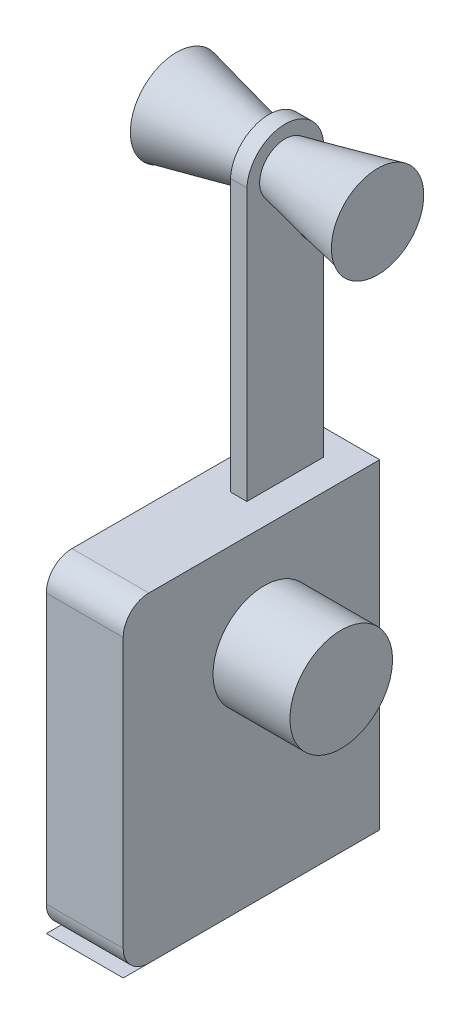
ISO-10303-21;
HEADER;
FILE_DESCRIPTION(('STEP AP214'),'2;1');
FILE_NAME('part.step','',(''),(''),'','','');
FILE_SCHEMA(('AUTOMOTIVE_DESIGN { 1 0 10303 214 1 1 1 1 }'));
ENDSEC;
DATA;
#1=APPLICATION_CONTEXT('core data for automotive mechanical design processes');
#2=APPLICATION_PROTOCOL_DEFINITION('international standard','automotive_design',2000,#1);
#3=PRODUCT_CONTEXT('',#1,'mechanical');
#4=PRODUCT('Part','Part','',(#3));
#5=PRODUCT_RELATED_PRODUCT_CATEGORY('part','',(#4));
#6=PRODUCT_DEFINITION_FORMATION('','',#4);
#7=PRODUCT_DEFINITION_CONTEXT('part definition',#1,'design');
#8=PRODUCT_DEFINITION('design','',#6,#7);
#9=PRODUCT_DEFINITION_SHAPE('','',#8);
#10=(LENGTH_UNIT() NAMED_UNIT(*) SI_UNIT(.MILLI.,.METRE.));
#11=(NAMED_UNIT(*) PLANE_ANGLE_UNIT() SI_UNIT($,.RADIAN.));
#12=(NAMED_UNIT(*) SI_UNIT($,.STERADIAN.) SOLID_ANGLE_UNIT());
#13=UNCERTAINTY_MEASURE_WITH_UNIT(LENGTH_MEASURE(1.E-05),#10,'distance_accuracy_value','');
#14=(GEOMETRIC_REPRESENTATION_CONTEXT(3) GLOBAL_UNCERTAINTY_ASSIGNED_CONTEXT((#13)) GLOBAL_UNIT_ASSIGNED_CONTEXT((#10,
#11,#12)) REPRESENTATION_CONTEXT('',''));
#15=CARTESIAN_POINT('',(0.,0.,0.));
#16=DIRECTION('',(0.,0.,1.));
#17=DIRECTION('',(1.,0.,0.));
#18=AXIS2_PLACEMENT_3D('',#15,#16,#17);
#19=CARTESIAN_POINT('',(-7.493,155.575,25.4));
#20=DIRECTION('',(-1.,0.,0.));
#21=DIRECTION('',(0.,0.,1.));
#22=AXIS2_PLACEMENT_3D('',#19,#20,#21);
#23=PLANE('',#22);
#24=CARTESIAN_POINT('',(-7.493,146.05,15.8933351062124));
#25=DIRECTION('',(1.,0.,0.));
#26=DIRECTION('',(0.,0.,-1.));
#27=AXIS2_PLACEMENT_3D('',#24,#25,#26);
#28=CIRCLE('',#27,6.35);
#29=CARTESIAN_POINT('',(-7.493,151.052776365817,19.8041826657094));
#30=VERTEX_POINT('',#29);
#31=EDGE_CURVE('E806',#30,#30,#28,.T.);
#32=ORIENTED_EDGE('',*,*,#31,.F.);
#33=EDGE_LOOP('',(#32));
#34=FACE_BOUND('',#33,.T.);
#35=DIRECTION('',(0.,-1.,0.));
#36=VECTOR('',#35,1.);
#37=CARTESIAN_POINT('',(-7.493,155.575,6.38667021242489));
#38=LINE('',#37,#36);
#39=CARTESIAN_POINT('',(-7.493,146.640717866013,6.38667021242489));
#40=VERTEX_POINT('',#39);
#41=CARTESIAN_POINT('',(-7.493,79.375,6.38667021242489));
#42=VERTEX_POINT('',#41);
#43=EDGE_CURVE('E85',#40,#42,#38,.T.);
#44=ORIENTED_EDGE('',*,*,#43,.F.);
#45=CARTESIAN_POINT('',(-7.493,146.05,15.8933351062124));
#46=DIRECTION('',(1.,0.,0.));
#47=DIRECTION('',(0.,0.,-1.));
#48=AXIS2_PLACEMENT_3D('',#45,#46,#47);
#49=CIRCLE('',#48,9.525);
#50=CARTESIAN_POINT('',(-7.493,146.640717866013,25.4));
#51=VERTEX_POINT('',#50);
#52=EDGE_CURVE('E186',#40,#51,#49,.T.);
#53=ORIENTED_EDGE('',*,*,#52,.T.);
#54=DIRECTION('',(0.,-1.,0.));
#55=VECTOR('',#54,1.);
#56=CARTESIAN_POINT('',(-7.493,155.575,25.4));
#57=LINE('',#56,#55);
#58=CARTESIAN_POINT('',(-7.493,79.375,25.4));
#59=VERTEX_POINT('',#58);
#60=EDGE_CURVE('E820',#51,#59,#57,.T.);
#61=ORIENTED_EDGE('',*,*,#60,.T.);
#62=DIRECTION('',(0.,0.,-1.));
#63=VECTOR('',#62,1.);
#64=CARTESIAN_POINT('',(-7.493,79.375,25.4));
#65=LINE('',#64,#63);
#66=EDGE_CURVE('E199',#59,#42,#65,.T.);
#67=ORIENTED_EDGE('',*,*,#66,.T.);
#68=EDGE_LOOP('',(#44,#53,#61,#67));
#69=FACE_BOUND('',#68,.T.);
#70=ADVANCED_FACE('F69',(#34,#69),#23,.F.);
#71=CARTESIAN_POINT('',(-11.557,155.575,25.4));
#72=DIRECTION('',(1.,0.,0.));
#73=DIRECTION('',(0.,0.,-1.));
#74=AXIS2_PLACEMENT_3D('',#71,#72,#73);
#75=PLANE('',#74);
#76=CARTESIAN_POINT('',(-11.557,146.05,15.8933351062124));
#77=DIRECTION('',(-1.,0.,0.));
#78=DIRECTION('',(0.,0.,1.));
#79=AXIS2_PLACEMENT_3D('',#76,#77,#78);
#80=CIRCLE('',#79,6.35);
#81=CARTESIAN_POINT('',(-11.557,148.840030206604,21.5975643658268));
#82=VERTEX_POINT('',#81);
#83=EDGE_CURVE('E825',#82,#82,#80,.T.);
#84=ORIENTED_EDGE('',*,*,#83,.F.);
#85=EDGE_LOOP('',(#84));
#86=FACE_BOUND('',#85,.T.);
#87=CARTESIAN_POINT('',(-11.557,146.05,15.8933351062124));
#88=DIRECTION('',(1.,0.,0.));
#89=DIRECTION('',(0.,0.,-1.));
#90=AXIS2_PLACEMENT_3D('',#87,#88,#89);
#91=CIRCLE('',#90,9.525);
#92=CARTESIAN_POINT('',(-11.557,146.640717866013,6.38667021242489));
#93=VERTEX_POINT('',#92);
#94=CARTESIAN_POINT('',(-11.557,146.640717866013,25.4));
#95=VERTEX_POINT('',#94);
#96=EDGE_CURVE('E810',#93,#95,#91,.T.);
#97=ORIENTED_EDGE('',*,*,#96,.F.);
#98=DIRECTION('',(0.,-1.,0.));
#99=VECTOR('',#98,1.);
#100=CARTESIAN_POINT('',(-11.557,155.575,6.3866702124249));
#101=LINE('',#100,#99);
#102=CARTESIAN_POINT('',(-11.557,79.375,6.3866702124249));
#103=VERTEX_POINT('',#102);
#104=EDGE_CURVE('E93',#93,#103,#101,.T.);
#105=ORIENTED_EDGE('',*,*,#104,.T.);
#106=DIRECTION('',(0.,0.,1.));
#107=VECTOR('',#106,1.);
#108=CARTESIAN_POINT('',(-11.557,79.375,25.4));
#109=LINE('',#108,#107);
#110=CARTESIAN_POINT('',(-11.557,79.375,25.4));
#111=VERTEX_POINT('',#110);
#112=EDGE_CURVE('E815',#103,#111,#109,.T.);
#113=ORIENTED_EDGE('',*,*,#112,.T.);
#114=DIRECTION('',(0.,-1.,0.));
#115=VECTOR('',#114,1.);
#116=CARTESIAN_POINT('',(-11.557,155.575,25.4));
#117=LINE('',#116,#115);
#118=EDGE_CURVE('E205',#95,#111,#117,.T.);
#119=ORIENTED_EDGE('',*,*,#118,.F.);
#120=EDGE_LOOP('',(#97,#105,#113,#119));
#121=FACE_BOUND('',#120,.T.);
#122=ADVANCED_FACE('F375',(#86,#121),#75,.F.);
#123=CARTESIAN_POINT('',(-11.557,155.575,6.3866702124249));
#124=DIRECTION('',(0.,0.,1.));
#125=DIRECTION('',(1.,0.,0.));
#126=AXIS2_PLACEMENT_3D('',#123,#124,#125);
#127=PLANE('',#126);
#128=DIRECTION('',(1.,0.,0.));
#129=VECTOR('',#128,1.);
#130=CARTESIAN_POINT('',(-83.693,146.640717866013,6.38667021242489));
#131=LINE('',#130,#129);
#132=EDGE_CURVE('E188',#93,#40,#131,.T.);
#133=ORIENTED_EDGE('',*,*,#132,.T.);
#134=ORIENTED_EDGE('',*,*,#43,.T.);
#135=DIRECTION('',(-1.,0.,0.));
#136=VECTOR('',#135,1.);
#137=CARTESIAN_POINT('',(-11.557,79.375,6.3866702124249));
#138=LINE('',#137,#136);
#139=EDGE_CURVE('E813',#42,#103,#138,.T.);
#140=ORIENTED_EDGE('',*,*,#139,.T.);
#141=ORIENTED_EDGE('',*,*,#104,.F.);
#142=EDGE_LOOP('',(#133,#134,#140,#141));
#143=FACE_BOUND('',#142,.T.);
#144=ADVANCED_FACE('F194',(#143),#127,.F.);
#145=CARTESIAN_POINT('',(-7.493,155.575,25.4));
#146=DIRECTION('',(0.,0.,-1.));
#147=DIRECTION('',(-1.,0.,0.));
#148=AXIS2_PLACEMENT_3D('',#145,#146,#147);
#149=PLANE('',#148);
#150=DIRECTION('',(1.,0.,0.));
#151=VECTOR('',#150,1.);
#152=CARTESIAN_POINT('',(-83.693,146.640717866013,25.4));
#153=LINE('',#152,#151);
#154=EDGE_CURVE('E190',#95,#51,#153,.T.);
#155=ORIENTED_EDGE('',*,*,#154,.F.);
#156=ORIENTED_EDGE('',*,*,#118,.T.);
#157=DIRECTION('',(1.,0.,0.));
#158=VECTOR('',#157,1.);
#159=CARTESIAN_POINT('',(-7.493,79.375,25.4));
#160=LINE('',#159,#158);
#161=EDGE_CURVE('E817',#111,#59,#160,.T.);
#162=ORIENTED_EDGE('',*,*,#161,.T.);
#163=ORIENTED_EDGE('',*,*,#60,.F.);
#164=EDGE_LOOP('',(#155,#156,#162,#163));
#165=FACE_BOUND('',#164,.T.);
#166=ADVANCED_FACE('F414',(#165),#149,.F.);
#167=CARTESIAN_POINT('',(0.,79.375,5.08));
#168=DIRECTION('',(0.,-1.,0.));
#169=DIRECTION('',(0.,0.,-1.));
#170=AXIS2_PLACEMENT_3D('',#167,#168,#169);
#171=PLANE('',#170);
#172=DIRECTION('',(0.,0.,-1.));
#173=VECTOR('',#172,1.);
#174=CARTESIAN_POINT('',(-19.05,79.375,5.08));
#175=LINE('',#174,#173);
#176=CARTESIAN_POINT('',(-19.05,79.375,57.1499999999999));
#177=VERTEX_POINT('',#176);
#178=CARTESIAN_POINT('',(-19.05,79.375,0.));
#179=VERTEX_POINT('',#178);
#180=EDGE_CURVE('E296',#177,#179,#175,.T.);
#181=ORIENTED_EDGE('',*,*,#180,.F.);
#182=DIRECTION('',(1.,0.,0.));
#183=VECTOR('',#182,1.);
#184=CARTESIAN_POINT('',(-58.42,79.375,57.1499999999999));
#185=LINE('',#184,#183);
#186=CARTESIAN_POINT('',(0.,79.375,57.1499999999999));
#187=VERTEX_POINT('',#186);
#188=EDGE_CURVE('E213',#177,#187,#185,.T.);
#189=ORIENTED_EDGE('',*,*,#188,.T.);
#190=DIRECTION('',(0.,0.,-1.));
#191=VECTOR('',#190,1.);
#192=CARTESIAN_POINT('',(0.,79.375,5.08));
#193=LINE('',#192,#191);
#194=CARTESIAN_POINT('',(0.,79.375,0.));
#195=VERTEX_POINT('',#194);
#196=EDGE_CURVE('E298',#187,#195,#193,.T.);
#197=ORIENTED_EDGE('',*,*,#196,.T.);
#198=DIRECTION('',(-1.,0.,0.));
#199=VECTOR('',#198,1.);
#200=CARTESIAN_POINT('',(0.,79.375,0.));
#201=LINE('',#200,#199);
#202=EDGE_CURVE('E280',#195,#179,#201,.T.);
#203=ORIENTED_EDGE('',*,*,#202,.T.);
#204=EDGE_LOOP('',(#181,#189,#197,#203));
#205=FACE_BOUND('',#204,.T.);
#206=ORIENTED_EDGE('',*,*,#66,.F.);
#207=ORIENTED_EDGE('',*,*,#161,.F.);
#208=ORIENTED_EDGE('',*,*,#112,.F.);
#209=ORIENTED_EDGE('',*,*,#139,.F.);
#210=EDGE_LOOP('',(#206,#207,#208,#209));
#211=FACE_BOUND('',#210,.T.);
#212=ADVANCED_FACE('F324',(#205,#211),#171,.F.);
#213=CARTESIAN_POINT('',(0.,0.,5.08));
#214=DIRECTION('',(-1.,0.,0.));
#215=DIRECTION('',(0.,0.,1.));
#216=AXIS2_PLACEMENT_3D('',#213,#214,#215);
#217=PLANE('',#216);
#218=CARTESIAN_POINT('',(0.,53.975,28.575));
#219=DIRECTION('',(1.,0.,0.));
#220=DIRECTION('',(0.,0.,-1.));
#221=AXIS2_PLACEMENT_3D('',#218,#219,#220);
#222=CIRCLE('',#221,12.7);
#223=CARTESIAN_POINT('',(0.,53.975,41.275));
#224=VERTEX_POINT('',#223);
#225=EDGE_CURVE('E12',#224,#224,#222,.T.);
#226=ORIENTED_EDGE('',*,*,#225,.F.);
#227=EDGE_LOOP('',(#226));
#228=FACE_BOUND('',#227,.T.);
#229=CARTESIAN_POINT('',(0.,6.35,57.15));
#230=DIRECTION('',(1.,0.,0.));
#231=DIRECTION('',(0.,0.,-1.));
#232=AXIS2_PLACEMENT_3D('',#229,#230,#231);
#233=CIRCLE('',#232,6.35);
#234=CARTESIAN_POINT('',(0.,6.35000000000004,63.5));
#235=VERTEX_POINT('',#234);
#236=CARTESIAN_POINT('',(0.,0.000765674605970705,57.2486077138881));
#237=VERTEX_POINT('',#236);
#238=EDGE_CURVE('E209',#235,#237,#233,.T.);
#239=ORIENTED_EDGE('',*,*,#238,.T.);
#240=DIRECTION('',(0.,0.000122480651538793,-0.999999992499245));
#241=VECTOR('',#240,1.);
#242=CARTESIAN_POINT('',(0.,0.00777752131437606,9.52595885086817E-07));
#243=LINE('',#242,#241);
#244=CARTESIAN_POINT('',(0.,0.,63.5));
#245=VERTEX_POINT('',#244);
#246=EDGE_CURVE('E212',#245,#237,#243,.T.);
#247=ORIENTED_EDGE('',*,*,#246,.F.);
#248=DIRECTION('',(0.,0.,-1.));
#249=VECTOR('',#248,1.);
#250=CARTESIAN_POINT('',(0.,0.,5.08));
#251=LINE('',#250,#249);
#252=CARTESIAN_POINT('',(0.,0.,0.));
#253=VERTEX_POINT('',#252);
#254=EDGE_CURVE('E300',#245,#253,#251,.T.);
#255=ORIENTED_EDGE('',*,*,#254,.T.);
#256=DIRECTION('',(0.,1.,0.));
#257=VECTOR('',#256,1.);
#258=CARTESIAN_POINT('',(0.,0.,0.));
#259=LINE('',#258,#257);
#260=EDGE_CURVE('E277',#253,#195,#259,.T.);
#261=ORIENTED_EDGE('',*,*,#260,.T.);
#262=ORIENTED_EDGE('',*,*,#196,.F.);
#263=CARTESIAN_POINT('',(0.,73.025,57.15));
#264=DIRECTION('',(1.,0.,0.));
#265=DIRECTION('',(0.,0.,-1.));
#266=AXIS2_PLACEMENT_3D('',#263,#264,#265);
#267=CIRCLE('',#266,6.34999999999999);
#268=CARTESIAN_POINT('',(0.,73.0249999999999,63.5));
#269=VERTEX_POINT('',#268);
#270=EDGE_CURVE('E203',#187,#269,#267,.T.);
#271=ORIENTED_EDGE('',*,*,#270,.T.);
#272=DIRECTION('',(0.,1.,0.));
#273=VECTOR('',#272,1.);
#274=CARTESIAN_POINT('',(0.,79.375,63.5));
#275=LINE('',#274,#273);
#276=EDGE_CURVE('E234',#235,#269,#275,.T.);
#277=ORIENTED_EDGE('',*,*,#276,.F.);
#278=EDGE_LOOP('',(#239,#247,#255,#261,#262,#271,#277));
#279=FACE_BOUND('',#278,.T.);
#280=ADVANCED_FACE('F317',(#228,#279),#217,.F.);
#281=CARTESIAN_POINT('',(-19.05,0.,5.08));
#282=DIRECTION('',(1.,0.,0.));
#283=DIRECTION('',(0.,1.,0.));
#284=AXIS2_PLACEMENT_3D('',#281,#282,#283);
#285=PLANE('',#284);
#286=CARTESIAN_POINT('',(-19.05,6.35,57.15));
#287=DIRECTION('',(1.,0.,0.));
#288=DIRECTION('',(0.,1.,0.));
#289=AXIS2_PLACEMENT_3D('',#286,#287,#288);
#290=CIRCLE('',#289,6.35);
#291=CARTESIAN_POINT('',(-19.05,6.35000000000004,63.5));
#292=VERTEX_POINT('',#291);
#293=CARTESIAN_POINT('',(-19.05,0.000765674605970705,57.2486077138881));
#294=VERTEX_POINT('',#293);
#295=EDGE_CURVE('E227',#292,#294,#290,.T.);
#296=ORIENTED_EDGE('',*,*,#295,.F.);
#297=DIRECTION('',(0.,-1.,0.));
#298=VECTOR('',#297,1.);
#299=CARTESIAN_POINT('',(-19.05,79.375,63.5));
#300=LINE('',#299,#298);
#301=CARTESIAN_POINT('',(-19.05,73.025,63.5));
#302=VERTEX_POINT('',#301);
#303=EDGE_CURVE('E229',#302,#292,#300,.T.);
#304=ORIENTED_EDGE('',*,*,#303,.F.);
#305=CARTESIAN_POINT('',(-19.05,73.025,57.15));
#306=DIRECTION('',(1.,0.,0.));
#307=DIRECTION('',(0.,1.,0.));
#308=AXIS2_PLACEMENT_3D('',#305,#306,#307);
#309=CIRCLE('',#308,6.34999999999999);
#310=EDGE_CURVE('E218',#177,#302,#309,.T.);
#311=ORIENTED_EDGE('',*,*,#310,.F.);
#312=ORIENTED_EDGE('',*,*,#180,.T.);
#313=DIRECTION('',(0.,-1.,0.));
#314=VECTOR('',#313,1.);
#315=CARTESIAN_POINT('',(-19.05,0.,0.));
#316=LINE('',#315,#314);
#317=CARTESIAN_POINT('',(-19.05,47.625,0.));
#318=VERTEX_POINT('',#317);
#319=EDGE_CURVE('E283',#179,#318,#316,.T.);
#320=ORIENTED_EDGE('',*,*,#319,.T.);
#321=DIRECTION('',(0.,0.,-1.));
#322=VECTOR('',#321,1.);
#323=CARTESIAN_POINT('',(-19.05,47.625,5.08));
#324=LINE('',#323,#322);
#325=CARTESIAN_POINT('',(-19.05,47.625,5.08));
#326=VERTEX_POINT('',#325);
#327=EDGE_CURVE('E293',#326,#318,#324,.T.);
#328=ORIENTED_EDGE('',*,*,#327,.F.);
#329=DIRECTION('',(0.,-1.,0.));
#330=VECTOR('',#329,1.);
#331=CARTESIAN_POINT('',(-19.05,79.375,5.08));
#332=LINE('',#331,#330);
#333=CARTESIAN_POINT('',(-19.05,0.,5.08));
#334=VERTEX_POINT('',#333);
#335=EDGE_CURVE('E238',#326,#334,#332,.T.);
#336=ORIENTED_EDGE('',*,*,#335,.T.);
#337=DIRECTION('',(0.,0.,-1.));
#338=VECTOR('',#337,1.);
#339=CARTESIAN_POINT('',(-19.05,0.,63.5));
#340=LINE('',#339,#338);
#341=CARTESIAN_POINT('',(-19.05,0.,63.5));
#342=VERTEX_POINT('',#341);
#343=EDGE_CURVE('E237',#342,#334,#340,.T.);
#344=ORIENTED_EDGE('',*,*,#343,.F.);
#345=DIRECTION('',(0.,0.000122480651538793,-0.999999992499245));
#346=VECTOR('',#345,1.);
#347=CARTESIAN_POINT('',(-19.05,0.00715531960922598,5.08000087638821));
#348=LINE('',#347,#346);
#349=EDGE_CURVE('E224',#342,#294,#348,.T.);
#350=ORIENTED_EDGE('',*,*,#349,.T.);
#351=EDGE_LOOP('',(#296,#304,#311,#312,#320,#328,#336,#344,#350));
#352=FACE_BOUND('',#351,.T.);
#353=ADVANCED_FACE('F329',(#352),#285,.F.);
#354=CARTESIAN_POINT('',(0.,0.,63.5));
#355=DIRECTION('',(0.,0.,1.));
#356=DIRECTION('',(1.,0.,0.));
#357=AXIS2_PLACEMENT_3D('',#354,#355,#356);
#358=PLANE('',#357);
#359=ORIENTED_EDGE('',*,*,#303,.T.);
#360=DIRECTION('',(1.,0.,0.));
#361=VECTOR('',#360,1.);
#362=CARTESIAN_POINT('',(-58.42,6.35,63.5));
#363=LINE('',#362,#361);
#364=EDGE_CURVE('E73',#292,#235,#363,.T.);
#365=ORIENTED_EDGE('',*,*,#364,.T.);
#366=ORIENTED_EDGE('',*,*,#276,.T.);
#367=DIRECTION('',(1.,0.,0.));
#368=VECTOR('',#367,1.);
#369=CARTESIAN_POINT('',(-58.42,73.025,63.5));
#370=LINE('',#369,#368);
#371=EDGE_CURVE('E241',#302,#269,#370,.T.);
#372=ORIENTED_EDGE('',*,*,#371,.F.);
#373=EDGE_LOOP('',(#359,#365,#366,#372));
#374=FACE_BOUND('',#373,.T.);
#375=ADVANCED_FACE('F312',(#374),#358,.T.);
#376=CARTESIAN_POINT('',(-38.1,0.,5.08));
#377=DIRECTION('',(1.,0.,0.));
#378=DIRECTION('',(0.,0.,-1.));
#379=AXIS2_PLACEMENT_3D('',#376,#377,#378);
#380=PLANE('',#379);
#381=DIRECTION('',(0.,-1.,0.));
#382=VECTOR('',#381,1.);
#383=CARTESIAN_POINT('',(-38.1,0.,0.));
#384=LINE('',#383,#382);
#385=CARTESIAN_POINT('',(-38.1,43.053,0.));
#386=VERTEX_POINT('',#385);
#387=CARTESIAN_POINT('',(-38.1,4.57200000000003,0.));
#388=VERTEX_POINT('',#387);
#389=EDGE_CURVE('E270',#386,#388,#384,.T.);
#390=ORIENTED_EDGE('',*,*,#389,.T.);
#391=DIRECTION('',(0.,0.,-1.));
#392=VECTOR('',#391,1.);
#393=CARTESIAN_POINT('',(-38.1,4.57200000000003,5.08));
#394=LINE('',#393,#392);
#395=CARTESIAN_POINT('',(-38.1,4.57200000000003,5.08));
#396=VERTEX_POINT('',#395);
#397=EDGE_CURVE('E242',#396,#388,#394,.T.);
#398=ORIENTED_EDGE('',*,*,#397,.F.);
#399=DIRECTION('',(0.,-1.,0.));
#400=VECTOR('',#399,1.);
#401=CARTESIAN_POINT('',(-38.1,0.,5.08));
#402=LINE('',#401,#400);
#403=CARTESIAN_POINT('',(-38.1,43.053,5.08));
#404=VERTEX_POINT('',#403);
#405=EDGE_CURVE('E253',#404,#396,#402,.T.);
#406=ORIENTED_EDGE('',*,*,#405,.F.);
#407=DIRECTION('',(0.,0.,-1.));
#408=VECTOR('',#407,1.);
#409=CARTESIAN_POINT('',(-38.1,43.053,5.08));
#410=LINE('',#409,#408);
#411=EDGE_CURVE('E264',#404,#386,#410,.T.);
#412=ORIENTED_EDGE('',*,*,#411,.T.);
#413=EDGE_LOOP('',(#390,#398,#406,#412));
#414=FACE_BOUND('',#413,.T.);
#415=ADVANCED_FACE('F365',(#414),#380,.F.);
#416=CARTESIAN_POINT('',(-33.528,4.572,5.08));
#417=DIRECTION('',(0.,0.,-1.));
#418=DIRECTION('',(-1.,0.,0.));
#419=AXIS2_PLACEMENT_3D('',#416,#417,#418);
#420=CYLINDRICAL_SURFACE('',#419,4.572);
#421=CARTESIAN_POINT('',(-33.528,4.572,0.));
#422=DIRECTION('',(0.,0.,1.));
#423=DIRECTION('',(1.,0.,0.));
#424=AXIS2_PLACEMENT_3D('',#421,#422,#423);
#425=CIRCLE('',#424,4.572);
#426=CARTESIAN_POINT('',(-33.528,0.,0.));
#427=VERTEX_POINT('',#426);
#428=EDGE_CURVE('E273',#388,#427,#425,.T.);
#429=ORIENTED_EDGE('',*,*,#428,.T.);
#430=DIRECTION('',(0.,0.,-1.));
#431=VECTOR('',#430,1.);
#432=CARTESIAN_POINT('',(-33.528,0.,5.08));
#433=LINE('',#432,#431);
#434=CARTESIAN_POINT('',(-33.528,0.,5.08));
#435=VERTEX_POINT('',#434);
#436=EDGE_CURVE('E303',#435,#427,#433,.T.);
#437=ORIENTED_EDGE('',*,*,#436,.F.);
#438=CARTESIAN_POINT('',(-33.528,4.572,5.08));
#439=DIRECTION('',(0.,0.,1.));
#440=DIRECTION('',(1.,0.,0.));
#441=AXIS2_PLACEMENT_3D('',#438,#439,#440);
#442=CIRCLE('',#441,4.572);
#443=EDGE_CURVE('E256',#396,#435,#442,.T.);
#444=ORIENTED_EDGE('',*,*,#443,.F.);
#445=ORIENTED_EDGE('',*,*,#397,.T.);
#446=EDGE_LOOP('',(#429,#437,#444,#445));
#447=FACE_BOUND('',#446,.T.);
#448=ADVANCED_FACE('F363',(#447),#420,.T.);
#449=CARTESIAN_POINT('',(0.,0.,5.08));
#450=DIRECTION('',(0.,1.,0.));
#451=DIRECTION('',(0.,0.,1.));
#452=AXIS2_PLACEMENT_3D('',#449,#450,#451);
#453=PLANE('',#452);
#454=DIRECTION('',(1.,0.,0.));
#455=VECTOR('',#454,1.);
#456=CARTESIAN_POINT('',(0.,0.,0.));
#457=LINE('',#456,#455);
#458=EDGE_CURVE('E275',#427,#253,#457,.T.);
#459=ORIENTED_EDGE('',*,*,#458,.T.);
#460=ORIENTED_EDGE('',*,*,#254,.F.);
#461=DIRECTION('',(1.,0.,0.));
#462=VECTOR('',#461,1.);
#463=CARTESIAN_POINT('',(-19.05,0.,63.5));
#464=LINE('',#463,#462);
#465=EDGE_CURVE('E232',#342,#245,#464,.T.);
#466=ORIENTED_EDGE('',*,*,#465,.F.);
#467=ORIENTED_EDGE('',*,*,#343,.T.);
#468=DIRECTION('',(1.,0.,0.));
#469=VECTOR('',#468,1.);
#470=CARTESIAN_POINT('',(0.,0.,5.08));
#471=LINE('',#470,#469);
#472=EDGE_CURVE('E258',#435,#334,#471,.T.);
#473=ORIENTED_EDGE('',*,*,#472,.F.);
#474=ORIENTED_EDGE('',*,*,#436,.T.);
#475=EDGE_LOOP('',(#459,#460,#466,#467,#473,#474));
#476=FACE_BOUND('',#475,.T.);
#477=ADVANCED_FACE('F340',(#476),#453,.F.);
#478=CARTESIAN_POINT('',(0.,47.625,5.08));
#479=DIRECTION('',(0.,-1.,0.));
#480=DIRECTION('',(0.,0.,-1.));
#481=AXIS2_PLACEMENT_3D('',#478,#479,#480);
#482=PLANE('',#481);
#483=DIRECTION('',(-1.,0.,0.));
#484=VECTOR('',#483,1.);
#485=CARTESIAN_POINT('',(0.,47.625,0.));
#486=LINE('',#485,#484);
#487=CARTESIAN_POINT('',(-33.528,47.625,0.));
#488=VERTEX_POINT('',#487);
#489=EDGE_CURVE('E285',#318,#488,#486,.T.);
#490=ORIENTED_EDGE('',*,*,#489,.T.);
#491=DIRECTION('',(0.,0.,-1.));
#492=VECTOR('',#491,1.);
#493=CARTESIAN_POINT('',(-33.528,47.625,5.08));
#494=LINE('',#493,#492);
#495=CARTESIAN_POINT('',(-33.528,47.625,5.08));
#496=VERTEX_POINT('',#495);
#497=EDGE_CURVE('E290',#496,#488,#494,.T.);
#498=ORIENTED_EDGE('',*,*,#497,.F.);
#499=DIRECTION('',(-1.,0.,0.));
#500=VECTOR('',#499,1.);
#501=CARTESIAN_POINT('',(0.,47.625,5.08));
#502=LINE('',#501,#500);
#503=EDGE_CURVE('E260',#326,#496,#502,.T.);
#504=ORIENTED_EDGE('',*,*,#503,.F.);
#505=ORIENTED_EDGE('',*,*,#327,.T.);
#506=EDGE_LOOP('',(#490,#498,#504,#505));
#507=FACE_BOUND('',#506,.T.);
#508=ADVANCED_FACE('F351',(#507),#482,.F.);
#509=CARTESIAN_POINT('',(-31.7499999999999,6.35,5.08));
#510=DIRECTION('',(0.,0.,-1.));
#511=DIRECTION('',(-1.,0.,0.));
#512=AXIS2_PLACEMENT_3D('',#509,#510,#511);
#513=CYLINDRICAL_SURFACE('',#512,2.286);
#514=CARTESIAN_POINT('',(-31.7499999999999,6.35,5.08));
#515=DIRECTION('',(0.,0.,1.));
#516=DIRECTION('',(1.,0.,0.));
#517=AXIS2_PLACEMENT_3D('',#514,#515,#516);
#518=CIRCLE('',#517,2.286);
#519=CARTESIAN_POINT('',(-29.4639999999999,6.35,5.08));
#520=VERTEX_POINT('',#519);
#521=EDGE_CURVE('E249',#520,#520,#518,.T.);
#522=ORIENTED_EDGE('',*,*,#521,.T.);
#523=EDGE_LOOP('',(#522));
#524=FACE_BOUND('',#523,.T.);
#525=CARTESIAN_POINT('',(-31.7499999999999,6.35,0.));
#526=DIRECTION('',(0.,0.,1.));
#527=DIRECTION('',(1.,0.,0.));
#528=AXIS2_PLACEMENT_3D('',#525,#526,#527);
#529=CIRCLE('',#528,2.286);
#530=CARTESIAN_POINT('',(-29.4639999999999,6.35,0.));
#531=VERTEX_POINT('',#530);
#532=EDGE_CURVE('E267',#531,#531,#529,.T.);
#533=ORIENTED_EDGE('',*,*,#532,.F.);
#534=EDGE_LOOP('',(#533));
#535=FACE_BOUND('',#534,.T.);
#536=ADVANCED_FACE('F409',(#524,#535),#513,.F.);
#537=CARTESIAN_POINT('',(-31.7499999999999,41.275,5.08));
#538=DIRECTION('',(0.,0.,-1.));
#539=DIRECTION('',(-1.,0.,0.));
#540=AXIS2_PLACEMENT_3D('',#537,#538,#539);
#541=CYLINDRICAL_SURFACE('',#540,2.286);
#542=CARTESIAN_POINT('',(-31.7499999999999,41.275,5.08));
#543=DIRECTION('',(0.,0.,1.));
#544=DIRECTION('',(1.,0.,0.));
#545=AXIS2_PLACEMENT_3D('',#542,#543,#544);
#546=CIRCLE('',#545,2.286);
#547=CARTESIAN_POINT('',(-29.4639999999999,41.275,5.08));
#548=VERTEX_POINT('',#547);
#549=EDGE_CURVE('E246',#548,#548,#546,.T.);
#550=ORIENTED_EDGE('',*,*,#549,.T.);
#551=EDGE_LOOP('',(#550));
#552=FACE_BOUND('',#551,.T.);
#553=CARTESIAN_POINT('',(-31.7499999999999,41.275,0.));
#554=DIRECTION('',(0.,0.,1.));
#555=DIRECTION('',(1.,0.,0.));
#556=AXIS2_PLACEMENT_3D('',#553,#554,#555);
#557=CIRCLE('',#556,2.286);
#558=CARTESIAN_POINT('',(-29.4639999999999,41.275,0.));
#559=VERTEX_POINT('',#558);
#560=EDGE_CURVE('E245',#559,#559,#557,.T.);
#561=ORIENTED_EDGE('',*,*,#560,.F.);
#562=EDGE_LOOP('',(#561));
#563=FACE_BOUND('',#562,.T.);
#564=ADVANCED_FACE('F71',(#552,#563),#541,.F.);
#565=CARTESIAN_POINT('',(-33.528,43.053,5.08));
#566=DIRECTION('',(0.,0.,-1.));
#567=DIRECTION('',(-1.,0.,0.));
#568=AXIS2_PLACEMENT_3D('',#565,#566,#567);
#569=CYLINDRICAL_SURFACE('',#568,4.572);
#570=CARTESIAN_POINT('',(-33.528,43.053,0.));
#571=DIRECTION('',(0.,0.,1.));
#572=DIRECTION('',(1.,0.,0.));
#573=AXIS2_PLACEMENT_3D('',#570,#571,#572);
#574=CIRCLE('',#573,4.572);
#575=EDGE_CURVE('E250',#488,#386,#574,.T.);
#576=ORIENTED_EDGE('',*,*,#575,.T.);
#577=ORIENTED_EDGE('',*,*,#411,.F.);
#578=CARTESIAN_POINT('',(-33.528,43.053,5.08));
#579=DIRECTION('',(0.,0.,1.));
#580=DIRECTION('',(1.,0.,0.));
#581=AXIS2_PLACEMENT_3D('',#578,#579,#580);
#582=CIRCLE('',#581,4.572);
#583=EDGE_CURVE('E262',#496,#404,#582,.T.);
#584=ORIENTED_EDGE('',*,*,#583,.F.);
#585=ORIENTED_EDGE('',*,*,#497,.T.);
#586=EDGE_LOOP('',(#576,#577,#584,#585));
#587=FACE_BOUND('',#586,.T.);
#588=ADVANCED_FACE('F355',(#587),#569,.T.);
#589=CARTESIAN_POINT('',(0.,0.,5.08));
#590=DIRECTION('',(0.,0.,1.));
#591=DIRECTION('',(1.,0.,0.));
#592=AXIS2_PLACEMENT_3D('',#589,#590,#591);
#593=PLANE('',#592);
#594=ORIENTED_EDGE('',*,*,#335,.F.);
#595=ORIENTED_EDGE('',*,*,#503,.T.);
#596=ORIENTED_EDGE('',*,*,#583,.T.);
#597=ORIENTED_EDGE('',*,*,#405,.T.);
#598=ORIENTED_EDGE('',*,*,#443,.T.);
#599=ORIENTED_EDGE('',*,*,#472,.T.);
#600=EDGE_LOOP('',(#594,#595,#596,#597,#598,#599));
#601=FACE_BOUND('',#600,.T.);
#602=ORIENTED_EDGE('',*,*,#549,.F.);
#603=EDGE_LOOP('',(#602));
#604=FACE_BOUND('',#603,.T.);
#605=ORIENTED_EDGE('',*,*,#521,.F.);
#606=EDGE_LOOP('',(#605));
#607=FACE_BOUND('',#606,.T.);
#608=ADVANCED_FACE('F359',(#601,#604,#607),#593,.T.);
#609=CARTESIAN_POINT('',(0.,0.,0.));
#610=DIRECTION('',(0.,0.,1.));
#611=DIRECTION('',(1.,0.,0.));
#612=AXIS2_PLACEMENT_3D('',#609,#610,#611);
#613=PLANE('',#612);
#614=ORIENTED_EDGE('',*,*,#560,.T.);
#615=EDGE_LOOP('',(#614));
#616=FACE_BOUND('',#615,.T.);
#617=ORIENTED_EDGE('',*,*,#532,.T.);
#618=EDGE_LOOP('',(#617));
#619=FACE_BOUND('',#618,.T.);
#620=ORIENTED_EDGE('',*,*,#389,.F.);
#621=ORIENTED_EDGE('',*,*,#575,.F.);
#622=ORIENTED_EDGE('',*,*,#489,.F.);
#623=ORIENTED_EDGE('',*,*,#319,.F.);
#624=ORIENTED_EDGE('',*,*,#202,.F.);
#625=ORIENTED_EDGE('',*,*,#260,.F.);
#626=ORIENTED_EDGE('',*,*,#458,.F.);
#627=ORIENTED_EDGE('',*,*,#428,.F.);
#628=EDGE_LOOP('',(#620,#621,#622,#623,#624,#625,#626,#627));
#629=FACE_BOUND('',#628,.T.);
#630=ADVANCED_FACE('F346',(#616,#619,#629),#613,.F.);
#631=CARTESIAN_POINT('',(-58.42,73.025,57.15));
#632=DIRECTION('',(1.,0.,0.));
#633=DIRECTION('',(0.,0.,-1.));
#634=AXIS2_PLACEMENT_3D('',#631,#632,#633);
#635=CYLINDRICAL_SURFACE('',#634,6.34999999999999);
#636=ORIENTED_EDGE('',*,*,#310,.T.);
#637=ORIENTED_EDGE('',*,*,#371,.T.);
#638=ORIENTED_EDGE('',*,*,#270,.F.);
#639=ORIENTED_EDGE('',*,*,#188,.F.);
#640=EDGE_LOOP('',(#636,#637,#638,#639));
#641=FACE_BOUND('',#640,.T.);
#642=ADVANCED_FACE('F320',(#641),#635,.T.);
#643=CARTESIAN_POINT('',(-58.42,6.35,57.15));
#644=DIRECTION('',(1.,0.,0.));
#645=DIRECTION('',(0.,0.,-1.));
#646=AXIS2_PLACEMENT_3D('',#643,#644,#645);
#647=CYLINDRICAL_SURFACE('',#646,6.35);
#648=ORIENTED_EDGE('',*,*,#295,.T.);
#649=DIRECTION('',(1.,0.,0.));
#650=VECTOR('',#649,1.);
#651=CARTESIAN_POINT('',(-58.42,0.000765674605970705,57.2486077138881));
#652=LINE('',#651,#650);
#653=EDGE_CURVE('E216',#294,#237,#652,.T.);
#654=ORIENTED_EDGE('',*,*,#653,.T.);
#655=ORIENTED_EDGE('',*,*,#238,.F.);
#656=ORIENTED_EDGE('',*,*,#364,.F.);
#657=EDGE_LOOP('',(#648,#654,#655,#656));
#658=FACE_BOUND('',#657,.T.);
#659=ADVANCED_FACE('F333',(#658),#647,.T.);
#660=CARTESIAN_POINT('',(-58.42,0.00777752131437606,9.52595885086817E-07));
#661=DIRECTION('',(0.,-0.999999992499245,-0.000122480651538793));
#662=DIRECTION('',(0.,0.000122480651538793,-0.999999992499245));
#663=AXIS2_PLACEMENT_3D('',#660,#661,#662);
#664=PLANE('',#663);
#665=ORIENTED_EDGE('',*,*,#465,.T.);
#666=ORIENTED_EDGE('',*,*,#246,.T.);
#667=ORIENTED_EDGE('',*,*,#653,.F.);
#668=ORIENTED_EDGE('',*,*,#349,.F.);
#669=EDGE_LOOP('',(#665,#666,#667,#668));
#670=FACE_BOUND('',#669,.T.);
#671=ADVANCED_FACE('F335',(#670),#664,.F.);
#672=CARTESIAN_POINT('',(19.05,53.975,28.575));
#673=DIRECTION('',(-1.,0.,0.));
#674=DIRECTION('',(0.,0.,1.));
#675=AXIS2_PLACEMENT_3D('',#672,#673,#674);
#676=CYLINDRICAL_SURFACE('',#675,12.7);
#677=CARTESIAN_POINT('',(19.05,53.975,28.575));
#678=DIRECTION('',(1.,0.,0.));
#679=DIRECTION('',(0.,0.,-1.));
#680=AXIS2_PLACEMENT_3D('',#677,#678,#679);
#681=CIRCLE('',#680,12.7);
#682=CARTESIAN_POINT('',(19.05,53.975,41.275));
#683=VERTEX_POINT('',#682);
#684=EDGE_CURVE('E200',#683,#683,#681,.T.);
#685=CARTESIAN_POINT('',(19.05,53.975,41.275));
#686=CARTESIAN_POINT('',(18.8515625,53.975,41.275));
#687=CARTESIAN_POINT('',(18.653125,53.975,41.275));
#688=CARTESIAN_POINT('',(18.25625,53.975,41.275));
#689=CARTESIAN_POINT('',(18.0578125,53.975,41.275));
#690=CARTESIAN_POINT('',(17.6609375,53.975,41.275));
#691=CARTESIAN_POINT('',(17.4625,53.975,41.275));
#692=CARTESIAN_POINT('',(17.065625,53.975,41.275));
#693=CARTESIAN_POINT('',(16.8671875,53.975,41.275));
#694=CARTESIAN_POINT('',(16.4703125,53.975,41.275));
#695=CARTESIAN_POINT('',(16.271875,53.975,41.275));
#696=CARTESIAN_POINT('',(15.875,53.975,41.275));
#697=CARTESIAN_POINT('',(15.6765625,53.975,41.275));
#698=CARTESIAN_POINT('',(15.2796875,53.975,41.275));
#699=CARTESIAN_POINT('',(15.08125,53.975,41.275));
#700=CARTESIAN_POINT('',(14.684375,53.975,41.275));
#701=CARTESIAN_POINT('',(14.4859375,53.975,41.275));
#702=CARTESIAN_POINT('',(14.0890625,53.975,41.275));
#703=CARTESIAN_POINT('',(13.890625,53.975,41.275));
#704=CARTESIAN_POINT('',(13.49375,53.975,41.275));
#705=CARTESIAN_POINT('',(13.2953125,53.975,41.275));
#706=CARTESIAN_POINT('',(12.8984375,53.975,41.275));
#707=CARTESIAN_POINT('',(12.7,53.975,41.275));
#708=CARTESIAN_POINT('',(12.303125,53.975,41.275));
#709=CARTESIAN_POINT('',(12.1046875,53.975,41.275));
#710=CARTESIAN_POINT('',(11.7078125,53.975,41.275));
#711=CARTESIAN_POINT('',(11.509375,53.975,41.275));
#712=CARTESIAN_POINT('',(11.1125,53.975,41.275));
#713=CARTESIAN_POINT('',(10.9140625,53.975,41.275));
#714=CARTESIAN_POINT('',(10.5171875,53.975,41.275));
#715=CARTESIAN_POINT('',(10.31875,53.975,41.275));
#716=CARTESIAN_POINT('',(9.921875,53.975,41.275));
#717=CARTESIAN_POINT('',(9.7234375,53.975,41.275));
#718=CARTESIAN_POINT('',(9.3265625,53.975,41.275));
#719=CARTESIAN_POINT('',(9.128125,53.975,41.275));
#720=CARTESIAN_POINT('',(8.73125,53.975,41.275));
#721=CARTESIAN_POINT('',(8.5328125,53.975,41.275));
#722=CARTESIAN_POINT('',(8.1359375,53.975,41.275));
#723=CARTESIAN_POINT('',(7.9375,53.975,41.275));
#724=CARTESIAN_POINT('',(7.540625,53.975,41.275));
#725=CARTESIAN_POINT('',(7.3421875,53.975,41.275));
#726=CARTESIAN_POINT('',(6.9453125,53.975,41.275));
#727=CARTESIAN_POINT('',(6.746875,53.975,41.275));
#728=CARTESIAN_POINT('',(6.35,53.975,41.275));
#729=CARTESIAN_POINT('',(6.1515625,53.975,41.275));
#730=CARTESIAN_POINT('',(5.7546875,53.975,41.275));
#731=CARTESIAN_POINT('',(5.55625,53.975,41.275));
#732=CARTESIAN_POINT('',(5.159375,53.975,41.275));
#733=CARTESIAN_POINT('',(4.9609375,53.975,41.275));
#734=CARTESIAN_POINT('',(4.5640625,53.975,41.275));
#735=CARTESIAN_POINT('',(4.365625,53.975,41.275));
#736=CARTESIAN_POINT('',(3.96875,53.975,41.275));
#737=CARTESIAN_POINT('',(3.7703125,53.975,41.275));
#738=CARTESIAN_POINT('',(3.3734375,53.975,41.275));
#739=CARTESIAN_POINT('',(3.175,53.975,41.275));
#740=CARTESIAN_POINT('',(2.778125,53.975,41.275));
#741=CARTESIAN_POINT('',(2.5796875,53.975,41.275));
#742=CARTESIAN_POINT('',(2.1828125,53.975,41.275));
#743=CARTESIAN_POINT('',(1.984375,53.975,41.275));
#744=CARTESIAN_POINT('',(1.5875,53.975,41.275));
#745=CARTESIAN_POINT('',(1.3890625,53.975,41.275));
#746=CARTESIAN_POINT('',(0.992187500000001,53.975,41.275));
#747=CARTESIAN_POINT('',(0.793750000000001,53.975,41.275));
#748=CARTESIAN_POINT('',(0.396875,53.975,41.275));
#749=CARTESIAN_POINT('',(0.1984375,53.975,41.275));
#750=CARTESIAN_POINT('',(0.,53.975,41.275));
#751=B_SPLINE_CURVE_WITH_KNOTS('',3,(#685,#686,#687,#688,#689,#690,#691,#692,#693,#694,#695,
#696,#697,#698,#699,#700,#701,#702,#703,#704,#705,#706,#707,#708,#709,#710,#711,#712,#713,#714,
#715,#716,#717,#718,#719,#720,#721,#722,#723,#724,#725,#726,#727,#728,#729,#730,#731,#732,#733,
#734,#735,#736,#737,#738,#739,#740,#741,#742,#743,#744,#745,#746,#747,#748,#749,#750),
.UNSPECIFIED.,.F.,.F.,(4,2,2,2,2,2,2,2,2,2,2,2,2,2,2,2,2,2,2,2,2,2,2,2,2,2,2,2,2,2,2,2,4),(0.,
0.595312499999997,1.190625,1.7859375,2.38125,2.9765625,3.571875,4.1671875,4.7625,5.3578125,
5.953125,6.5484375,7.14375,7.7390625,8.334375,8.9296875,9.525,10.1203125,10.715625,11.3109375,
11.90625,12.5015625,13.096875,13.6921875,14.2875,14.8828125,15.478125,16.0734375,16.66875,
17.2640625,17.859375,18.4546875,19.05),.UNSPECIFIED.);
#752=EDGE_CURVE('BSEAM389',#683,#224,#751,.T.);
#753=ORIENTED_EDGE('',*,*,#684,.F.);
#754=ORIENTED_EDGE('',*,*,#225,.T.);
#755=ORIENTED_EDGE('',*,*,#752,.T.);
#756=ORIENTED_EDGE('',*,*,#752,.F.);
#757=EDGE_LOOP('',(#753,#755,#754,#756));
#758=FACE_BOUND('',#757,.T.);
#759=ADVANCED_FACE('F389',(#758),#676,.T.);
#760=CARTESIAN_POINT('',(19.05,53.975,28.575));
#761=DIRECTION('',(1.,0.,0.));
#762=DIRECTION('',(0.,0.,-1.));
#763=AXIS2_PLACEMENT_3D('',#760,#761,#762);
#764=PLANE('',#763);
#765=ORIENTED_EDGE('',*,*,#684,.T.);
#766=EDGE_LOOP('',(#765));
#767=FACE_BOUND('',#766,.T.);
#768=ADVANCED_FACE('F386',(#767),#764,.T.);
#769=CARTESIAN_POINT('',(-83.693,146.05,15.8933351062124));
#770=DIRECTION('',(1.,0.,0.));
#771=DIRECTION('',(0.,0.,-1.));
#772=AXIS2_PLACEMENT_3D('',#769,#770,#771);
#773=CYLINDRICAL_SURFACE('',#772,9.525);
#774=ORIENTED_EDGE('',*,*,#96,.T.);
#775=ORIENTED_EDGE('',*,*,#154,.T.);
#776=ORIENTED_EDGE('',*,*,#52,.F.);
#777=ORIENTED_EDGE('',*,*,#132,.F.);
#778=EDGE_LOOP('',(#774,#775,#776,#777));
#779=FACE_BOUND('',#778,.T.);
#780=ADVANCED_FACE('F187',(#779),#773,.T.);
#781=CARTESIAN_POINT('',(15.367,146.05,15.8933351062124));
#782=DIRECTION('',(1.,0.,0.));
#783=DIRECTION('',(0.,0.,-1.));
#784=AXIS2_PLACEMENT_3D('',#781,#782,#783);
#785=PLANE('',#784);
#786=CARTESIAN_POINT('',(15.367,146.05,15.8933351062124));
#787=DIRECTION('',(1.,0.,0.));
#788=DIRECTION('',(0.,0.,-1.));
#789=AXIS2_PLACEMENT_3D('',#786,#787,#788);
#790=CIRCLE('',#789,11.43);
#791=CARTESIAN_POINT('',(15.367,156.419528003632,20.7014312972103));
#792=VERTEX_POINT('',#791);
#793=EDGE_CURVE('E195',#792,#792,#790,.T.);
#794=ORIENTED_EDGE('',*,*,#793,.T.);
#795=EDGE_LOOP('',(#794));
#796=FACE_BOUND('',#795,.T.);
#797=ADVANCED_FACE('F473',(#796),#785,.T.);
#798=CARTESIAN_POINT('',(-7.493,151.052776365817,19.8041826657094));
#799=CARTESIAN_POINT('',(15.367,156.419528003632,20.7014312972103));
#800=CARTESIAN_POINT('',(-7.493,143.231081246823,29.8097353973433));
#801=CARTESIAN_POINT('',(15.367,146.803335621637,41.4404873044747));
#802=CARTESIAN_POINT('',(-7.493,133.225528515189,21.9880402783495));
#803=CARTESIAN_POINT('',(15.367,126.064279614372,31.824294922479));
#804=CARTESIAN_POINT('',(-7.493,141.047223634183,11.9824875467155));
#805=CARTESIAN_POINT('',(15.367,135.680471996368,11.0852389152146));
#806=CARTESIAN_POINT('',(-7.493,148.868918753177,1.97693481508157));
#807=CARTESIAN_POINT('',(15.367,145.296664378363,-9.65381709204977));
#808=CARTESIAN_POINT('',(-7.493,158.874471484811,9.79862993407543));
#809=CARTESIAN_POINT('',(15.367,166.035720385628,-0.0376247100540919));
#810=CARTESIAN_POINT('',(-7.493,151.052776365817,19.8041826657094));
#811=CARTESIAN_POINT('',(15.367,156.419528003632,20.7014312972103));
#812=(BOUNDED_SURFACE() B_SPLINE_SURFACE(3,1,((#798,#799),(#800,#801),(#802,#803),(#804,#805),
(#806,#807),(#808,#809),(#810,#811)),.UNSPECIFIED.,.T.,.F.,.F.) B_SPLINE_SURFACE_WITH_KNOTS((4,
3,4),(2,2),(0.,0.5,1.),(0.,1.),
.UNSPECIFIED.) GEOMETRIC_REPRESENTATION_ITEM() RATIONAL_B_SPLINE_SURFACE(((1.,1.),
(0.333333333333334,0.333333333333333),(0.333333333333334,0.333333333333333),(1.,1.),
(0.333333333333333,0.333333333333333),(0.333333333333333,0.333333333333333),(1.,1.))) REPRESENTATION_ITEM('') SURFACE());
#813=CARTESIAN_POINT('',(-7.493,151.052776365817,19.8041826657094));
#814=CARTESIAN_POINT('',(-7.254875,151.108680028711,19.8135290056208));
#815=CARTESIAN_POINT('',(-7.01675,151.164583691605,19.8228753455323));
#816=CARTESIAN_POINT('',(-6.5405,151.276391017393,19.8415680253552));
#817=CARTESIAN_POINT('',(-6.302375,151.332294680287,19.8509143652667));
#818=CARTESIAN_POINT('',(-5.82612499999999,151.444102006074,19.8696070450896));
#819=CARTESIAN_POINT('',(-5.588,151.500005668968,19.8789533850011));
#820=CARTESIAN_POINT('',(-5.11175,151.611812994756,19.8976460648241));
#821=CARTESIAN_POINT('',(-4.873625,151.66771665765,19.9069924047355));
#822=CARTESIAN_POINT('',(-4.397375,151.779523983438,19.9256850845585));
#823=CARTESIAN_POINT('',(-4.15925,151.835427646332,19.9350314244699));
#824=CARTESIAN_POINT('',(-3.683,151.94723497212,19.9537241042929));
#825=CARTESIAN_POINT('',(-3.444875,152.003138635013,19.9630704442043));
#826=CARTESIAN_POINT('',(-2.968625,152.114945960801,19.9817631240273));
#827=CARTESIAN_POINT('',(-2.7305,152.170849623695,19.9911094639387));
#828=CARTESIAN_POINT('',(-2.25425,152.282656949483,20.0098021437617));
#829=CARTESIAN_POINT('',(-2.016125,152.338560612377,20.0191484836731));
#830=CARTESIAN_POINT('',(-1.539875,152.450367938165,20.0378411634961));
#831=CARTESIAN_POINT('',(-1.30175,152.506271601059,20.0471875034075));
#832=CARTESIAN_POINT('',(-0.825499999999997,152.618078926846,20.0658801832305));
#833=CARTESIAN_POINT('',(-0.587374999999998,152.67398258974,20.0752265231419));
#834=CARTESIAN_POINT('',(-0.111124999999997,152.785789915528,20.0939192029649));
#835=CARTESIAN_POINT('',(0.127000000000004,152.841693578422,20.1032655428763));
#836=CARTESIAN_POINT('',(0.603250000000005,152.95350090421,20.1219582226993));
#837=CARTESIAN_POINT('',(0.841375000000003,153.009404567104,20.1313045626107));
#838=CARTESIAN_POINT('',(1.317625,153.121211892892,20.1499972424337));
#839=CARTESIAN_POINT('',(1.55575,153.177115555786,20.1593435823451));
#840=CARTESIAN_POINT('',(2.032,153.288922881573,20.1780362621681));
#841=CARTESIAN_POINT('',(2.270125,153.344826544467,20.1873826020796));
#842=CARTESIAN_POINT('',(2.746375,153.456633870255,20.2060752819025));
#843=CARTESIAN_POINT('',(2.9845,153.512537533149,20.215421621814));
#844=CARTESIAN_POINT('',(3.46075,153.624344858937,20.2341143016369));
#845=CARTESIAN_POINT('',(3.698875,153.680248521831,20.2434606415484));
#846=CARTESIAN_POINT('',(4.175125,153.792055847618,20.2621533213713));
#847=CARTESIAN_POINT('',(4.41325,153.847959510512,20.2714996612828));
#848=CARTESIAN_POINT('',(4.8895,153.9597668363,20.2901923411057));
#849=CARTESIAN_POINT('',(5.127625,154.015670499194,20.2995386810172));
#850=CARTESIAN_POINT('',(5.603875,154.127477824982,20.3182313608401));
#851=CARTESIAN_POINT('',(5.842,154.183381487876,20.3275777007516));
#852=CARTESIAN_POINT('',(6.31825,154.295188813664,20.3462703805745));
#853=CARTESIAN_POINT('',(6.556375,154.351092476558,20.355616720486));
#854=CARTESIAN_POINT('',(7.032625,154.462899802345,20.3743094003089));
#855=CARTESIAN_POINT('',(7.27075,154.518803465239,20.3836557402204));
#856=CARTESIAN_POINT('',(7.747,154.630610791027,20.4023484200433));
#857=CARTESIAN_POINT('',(7.985125,154.686514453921,20.4116947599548));
#858=CARTESIAN_POINT('',(8.461375,154.798321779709,20.4303874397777));
#859=CARTESIAN_POINT('',(8.6995,154.854225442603,20.4397337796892));
#860=CARTESIAN_POINT('',(9.17575,154.966032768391,20.4584264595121));
#861=CARTESIAN_POINT('',(9.413875,155.021936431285,20.4677727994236));
#862=CARTESIAN_POINT('',(9.890125,155.133743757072,20.4864654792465));
#863=CARTESIAN_POINT('',(10.12825,155.189647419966,20.495811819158));
#864=CARTESIAN_POINT('',(10.6045,155.301454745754,20.5145044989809));
#865=CARTESIAN_POINT('',(10.842625,155.357358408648,20.5238508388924));
#866=CARTESIAN_POINT('',(11.318875,155.469165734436,20.5425435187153));
#867=CARTESIAN_POINT('',(11.557,155.52506939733,20.5518898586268));
#868=CARTESIAN_POINT('',(12.03325,155.636876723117,20.5705825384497));
#869=CARTESIAN_POINT('',(12.271375,155.692780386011,20.5799288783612));
#870=CARTESIAN_POINT('',(12.747625,155.804587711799,20.5986215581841));
#871=CARTESIAN_POINT('',(12.98575,155.860491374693,20.6079678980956));
#872=CARTESIAN_POINT('',(13.462,155.972298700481,20.6266605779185));
#873=CARTESIAN_POINT('',(13.700125,156.028202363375,20.63600691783));
#874=CARTESIAN_POINT('',(14.176375,156.140009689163,20.6546995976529));
#875=CARTESIAN_POINT('',(14.4145,156.195913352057,20.6640459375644));
#876=CARTESIAN_POINT('',(14.89075,156.307720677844,20.6827386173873));
#877=CARTESIAN_POINT('',(15.128875,156.363624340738,20.6920849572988));
#878=CARTESIAN_POINT('',(15.367,156.419528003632,20.7014312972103));
#879=B_SPLINE_CURVE_WITH_KNOTS('',3,(#813,#814,#815,#816,#817,#818,#819,#820,#821,#822,#823,
#824,#825,#826,#827,#828,#829,#830,#831,#832,#833,#834,#835,#836,#837,#838,#839,#840,#841,#842,
#843,#844,#845,#846,#847,#848,#849,#850,#851,#852,#853,#854,#855,#856,#857,#858,#859,#860,#861,
#862,#863,#864,#865,#866,#867,#868,#869,#870,#871,#872,#873,#874,#875,#876,#877,#878),
.UNSPECIFIED.,.F.,.F.,(4,2,2,2,2,2,2,2,2,2,2,2,2,2,2,2,2,2,2,2,2,2,2,2,2,2,2,2,2,2,2,2,4),(0.,
0.734332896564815,1.46866579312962,2.20299868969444,2.93733158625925,3.67166448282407,
4.40599737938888,5.14033027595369,5.8746631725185,6.60899606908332,7.34332896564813,
8.07766186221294,8.81199475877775,9.54632765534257,10.2806605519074,11.0149934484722,
11.749326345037,12.4836592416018,13.2179921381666,13.9523250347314,14.6866579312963,
15.4209908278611,16.1553237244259,16.8896566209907,17.6239895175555,18.3583224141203,
19.0926553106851,19.8269882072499,20.5613211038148,21.2956540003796,22.0299868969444,
22.7643197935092,23.498652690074),.UNSPECIFIED.);
#880=EDGE_CURVE('BSEAM480',#30,#792,#879,.T.);
#881=ORIENTED_EDGE('',*,*,#31,.T.);
#882=ORIENTED_EDGE('',*,*,#793,.F.);
#883=ORIENTED_EDGE('',*,*,#880,.T.);
#884=ORIENTED_EDGE('',*,*,#880,.F.);
#885=EDGE_LOOP('',(#881,#883,#882,#884));
#886=FACE_BOUND('',#885,.T.);
#887=ADVANCED_FACE('F480',(#886),#812,.T.);
#888=CARTESIAN_POINT('',(-34.417,146.05,15.8933351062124));
#889=DIRECTION('',(-1.,0.,0.));
#890=DIRECTION('',(0.,0.,1.));
#891=AXIS2_PLACEMENT_3D('',#888,#889,#890);
#892=PLANE('',#891);
#893=CARTESIAN_POINT('',(-34.417,146.05,15.8933351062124));
#894=DIRECTION('',(-1.,0.,0.));
#895=DIRECTION('',(0.,0.,1.));
#896=AXIS2_PLACEMENT_3D('',#893,#894,#895);
#897=CIRCLE('',#896,11.43);
#898=CARTESIAN_POINT('',(-34.417,153.445849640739,24.6080530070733));
#899=VERTEX_POINT('',#898);
#900=EDGE_CURVE('E827',#899,#899,#897,.T.);
#901=ORIENTED_EDGE('',*,*,#900,.T.);
#902=EDGE_LOOP('',(#901));
#903=FACE_BOUND('',#902,.T.);
#904=ADVANCED_FACE('F488',(#903),#892,.T.);
#905=CARTESIAN_POINT('',(-34.417,153.445849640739,24.6080530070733));
#906=CARTESIAN_POINT('',(-11.557,148.840030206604,21.5975643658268));
#907=CARTESIAN_POINT('',(-34.417,136.016413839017,39.3997522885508));
#908=CARTESIAN_POINT('',(-11.557,137.431571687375,27.1776247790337));
#909=CARTESIAN_POINT('',(-34.417,121.22471455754,21.9703164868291));
#910=CARTESIAN_POINT('',(-11.557,131.851511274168,15.7691662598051));
#911=CARTESIAN_POINT('',(-34.417,138.654150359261,7.17861720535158));
#912=CARTESIAN_POINT('',(-11.557,143.259969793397,10.1891058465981));
#913=CARTESIAN_POINT('',(-34.417,156.083586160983,-7.61308207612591));
#914=CARTESIAN_POINT('',(-11.557,154.668428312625,4.60904543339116));
#915=CARTESIAN_POINT('',(-34.417,170.87528544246,9.8163537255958));
#916=CARTESIAN_POINT('',(-11.557,160.248488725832,16.0175039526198));
#917=CARTESIAN_POINT('',(-34.417,153.445849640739,24.6080530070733));
#918=CARTESIAN_POINT('',(-11.557,148.840030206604,21.5975643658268));
#919=(BOUNDED_SURFACE() B_SPLINE_SURFACE(3,1,((#905,#906),(#907,#908),(#909,#910),(#911,#912),
(#913,#914),(#915,#916),(#917,#918)),.UNSPECIFIED.,.T.,.F.,.F.) B_SPLINE_SURFACE_WITH_KNOTS((4,
3,4),(2,2),(0.,0.5,1.),(0.,1.),
.UNSPECIFIED.) GEOMETRIC_REPRESENTATION_ITEM() RATIONAL_B_SPLINE_SURFACE(((1.,1.),
(0.333333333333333,0.333333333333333),(0.333333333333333,0.333333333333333),(1.,1.),
(0.333333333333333,0.333333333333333),(0.333333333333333,0.333333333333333),(1.,1.))) REPRESENTATION_ITEM('') SURFACE());
#920=CARTESIAN_POINT('',(-34.417,153.445849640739,24.6080530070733));
#921=CARTESIAN_POINT('',(-34.178875,153.397872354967,24.5766937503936));
#922=CARTESIAN_POINT('',(-33.94075,153.349895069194,24.545334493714));
#923=CARTESIAN_POINT('',(-33.4645,153.25394049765,24.4826159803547));
#924=CARTESIAN_POINT('',(-33.226375,153.205963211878,24.451256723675));
#925=CARTESIAN_POINT('',(-32.750125,153.110008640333,24.3885382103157));
#926=CARTESIAN_POINT('',(-32.512,153.062031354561,24.3571789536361));
#927=CARTESIAN_POINT('',(-32.03575,152.966076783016,24.2944604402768));
#928=CARTESIAN_POINT('',(-31.797625,152.918099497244,24.2631011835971));
#929=CARTESIAN_POINT('',(-31.321375,152.8221449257,24.2003826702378));
#930=CARTESIAN_POINT('',(-31.08325,152.774167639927,24.1690234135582));
#931=CARTESIAN_POINT('',(-30.607,152.678213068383,24.1063049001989));
#932=CARTESIAN_POINT('',(-30.368875,152.630235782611,24.0749456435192));
#933=CARTESIAN_POINT('',(-29.892625,152.534281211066,24.0122271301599));
#934=CARTESIAN_POINT('',(-29.6545,152.486303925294,23.9808678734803));
#935=CARTESIAN_POINT('',(-29.17825,152.390349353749,23.918149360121));
#936=CARTESIAN_POINT('',(-28.940125,152.342372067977,23.8867901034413));
#937=CARTESIAN_POINT('',(-28.463875,152.246417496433,23.824071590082));
#938=CARTESIAN_POINT('',(-28.22575,152.19844021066,23.7927123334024));
#939=CARTESIAN_POINT('',(-27.7495,152.102485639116,23.7299938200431));
#940=CARTESIAN_POINT('',(-27.511375,152.054508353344,23.6986345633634));
#941=CARTESIAN_POINT('',(-27.035125,151.958553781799,23.6359160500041));
#942=CARTESIAN_POINT('',(-26.797,151.910576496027,23.6045567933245));
#943=CARTESIAN_POINT('',(-26.32075,151.814621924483,23.5418382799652));
#944=CARTESIAN_POINT('',(-26.082625,151.76664463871,23.5104790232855));
#945=CARTESIAN_POINT('',(-25.606375,151.670690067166,23.4477605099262));
#946=CARTESIAN_POINT('',(-25.36825,151.622712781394,23.4164012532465));
#947=CARTESIAN_POINT('',(-24.892,151.526758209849,23.3536827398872));
#948=CARTESIAN_POINT('',(-24.653875,151.478780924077,23.3223234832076));
#949=CARTESIAN_POINT('',(-24.177625,151.382826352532,23.2596049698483));
#950=CARTESIAN_POINT('',(-23.9395,151.33484906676,23.2282457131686));
#951=CARTESIAN_POINT('',(-23.46325,151.238894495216,23.1655271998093));
#952=CARTESIAN_POINT('',(-23.225125,151.190917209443,23.1341679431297));
#953=CARTESIAN_POINT('',(-22.748875,151.094962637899,23.0714494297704));
#954=CARTESIAN_POINT('',(-22.51075,151.046985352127,23.0400901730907));
#955=CARTESIAN_POINT('',(-22.0345,150.951030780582,22.9773716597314));
#956=CARTESIAN_POINT('',(-21.796375,150.90305349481,22.9460124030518));
#957=CARTESIAN_POINT('',(-21.320125,150.807098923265,22.8832938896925));
#958=CARTESIAN_POINT('',(-21.082,150.759121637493,22.8519346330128));
#959=CARTESIAN_POINT('',(-20.60575,150.663167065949,22.7892161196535));
#960=CARTESIAN_POINT('',(-20.367625,150.615189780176,22.7578568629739));
#961=CARTESIAN_POINT('',(-19.891375,150.519235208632,22.6951383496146));
#962=CARTESIAN_POINT('',(-19.65325,150.47125792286,22.6637790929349));
#963=CARTESIAN_POINT('',(-19.177,150.375303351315,22.6010605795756));
#964=CARTESIAN_POINT('',(-18.938875,150.327326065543,22.569701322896));
#965=CARTESIAN_POINT('',(-18.462625,150.231371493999,22.5069828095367));
#966=CARTESIAN_POINT('',(-18.2245,150.183394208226,22.475623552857));
#967=CARTESIAN_POINT('',(-17.74825,150.087439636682,22.4129050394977));
#968=CARTESIAN_POINT('',(-17.510125,150.03946235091,22.381545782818));
#969=CARTESIAN_POINT('',(-17.033875,149.943507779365,22.3188272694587));
#970=CARTESIAN_POINT('',(-16.79575,149.895530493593,22.2874680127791));
#971=CARTESIAN_POINT('',(-16.3195,149.799575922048,22.2247494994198));
#972=CARTESIAN_POINT('',(-16.081375,149.751598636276,22.1933902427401));
#973=CARTESIAN_POINT('',(-15.605125,149.655644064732,22.1306717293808));
#974=CARTESIAN_POINT('',(-15.367,149.607666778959,22.0993124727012));
#975=CARTESIAN_POINT('',(-14.89075,149.511712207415,22.0365939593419));
#976=CARTESIAN_POINT('',(-14.652625,149.463734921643,22.0052347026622));
#977=CARTESIAN_POINT('',(-14.176375,149.367780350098,21.9425161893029));
#978=CARTESIAN_POINT('',(-13.93825,149.319803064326,21.9111569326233));
#979=CARTESIAN_POINT('',(-13.462,149.223848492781,21.848438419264));
#980=CARTESIAN_POINT('',(-13.223875,149.175871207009,21.8170791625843));
#981=CARTESIAN_POINT('',(-12.747625,149.079916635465,21.754360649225));
#982=CARTESIAN_POINT('',(-12.5095,149.031939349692,21.7230013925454));
#983=CARTESIAN_POINT('',(-12.03325,148.935984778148,21.6602828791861));
#984=CARTESIAN_POINT('',(-11.795125,148.888007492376,21.6289236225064));
#985=CARTESIAN_POINT('',(-11.557,148.840030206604,21.5975643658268));
#986=B_SPLINE_CURVE_WITH_KNOTS('',3,(#920,#921,#922,#923,#924,#925,#926,#927,#928,#929,#930,
#931,#932,#933,#934,#935,#936,#937,#938,#939,#940,#941,#942,#943,#944,#945,#946,#947,#948,#949,
#950,#951,#952,#953,#954,#955,#956,#957,#958,#959,#960,#961,#962,#963,#964,#965,#966,#967,#968,
#969,#970,#971,#972,#973,#974,#975,#976,#977,#978,#979,#980,#981,#982,#983,#984,#985),
.UNSPECIFIED.,.F.,.F.,(4,2,2,2,2,2,2,2,2,2,2,2,2,2,2,2,2,2,2,2,2,2,2,2,2,2,2,2,2,2,2,2,4),(0.,
0.734777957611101,1.46955591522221,2.20433387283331,2.93911183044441,3.67388978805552,
4.40866774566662,5.14344570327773,5.87822366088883,6.61300161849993,7.34777957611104,
8.08255753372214,8.81733549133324,9.55211344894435,10.2868914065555,11.0216693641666,
11.7564473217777,12.4912252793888,13.2260032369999,13.960781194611,14.6955591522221,
15.4303371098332,16.1651150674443,16.8998930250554,17.6346709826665,18.3694489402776,
19.1042268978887,19.8390048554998,20.5737828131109,21.308560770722,22.0433387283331,
22.7781166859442,23.5128946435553),.UNSPECIFIED.);
#987=EDGE_CURVE('BSEAM496',#899,#82,#986,.T.);
#988=ORIENTED_EDGE('',*,*,#900,.F.);
#989=ORIENTED_EDGE('',*,*,#83,.T.);
#990=ORIENTED_EDGE('',*,*,#987,.T.);
#991=ORIENTED_EDGE('',*,*,#987,.F.);
#992=EDGE_LOOP('',(#988,#990,#989,#991));
#993=FACE_BOUND('',#992,.T.);
#994=ADVANCED_FACE('F496',(#993),#919,.T.);
#995=CLOSED_SHELL('',(#70,#122,#144,#166,#212,#280,#353,#375,#415,#448,#477,#508,#536,#564,#588,
#608,#630,#642,#659,#671,#759,#768,#780,#797,#887,#904,#994));
#996=MANIFOLD_SOLID_BREP('B2',#995);
#997=ADVANCED_BREP_SHAPE_REPRESENTATION('',(#18,#996),#14);
#998=SHAPE_DEFINITION_REPRESENTATION(#9,#997);
ENDSEC;
END-ISO-10303-21;
